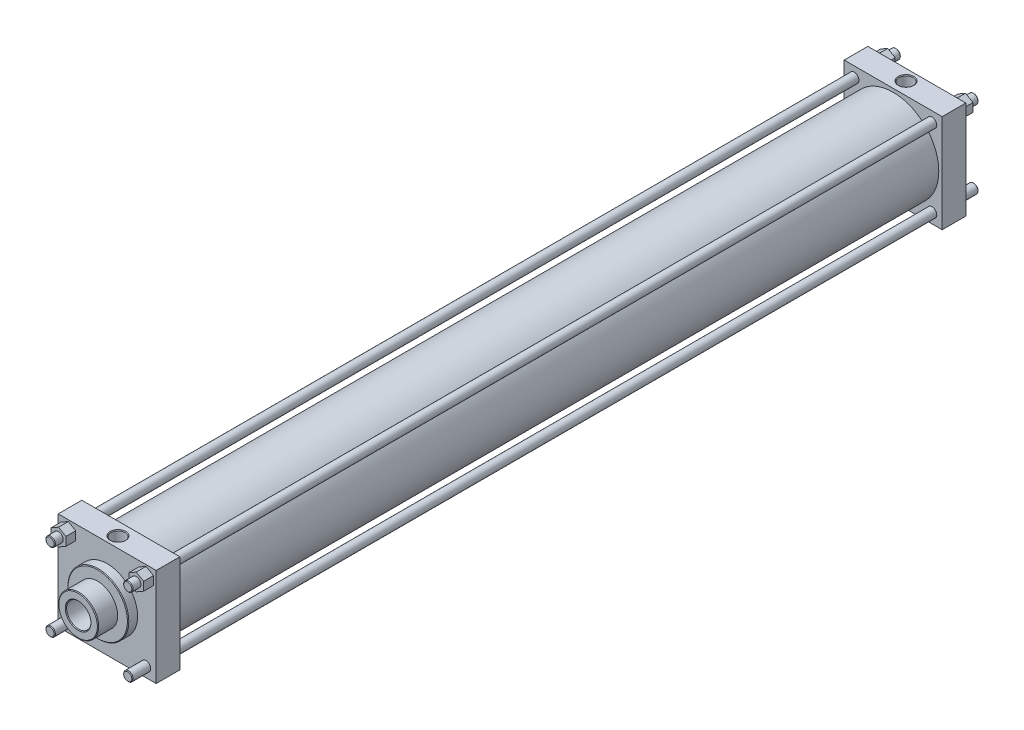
from build123d import *

# Parameters (mm, degrees)
BASE_EXTRUDE_DEPTH      = 599
BASE_EXTRUDE_DEPTH_BACK = 599
SKETCH1_R               = 67.5
SKETCH2_W               = 35
SKETCH2_H               = 145
COVERS_DEPTH            = 72.5
TIERODS_START           = -626
SKETCH4_R               = 7
TIERODS_DEPTH           = 1252
PORTS_START             = -72.5
SKETCH5_R               = 10.5
PORTS_DEPTH             = 72.5
BORE_START              = -1194.5
SKETCH6_R               = 18
BORE_DEPTH              = 1194.5
SKETCH7_R               = 62.5
STROKECHAMBER_DEPTH     = 1105
CHAMFER1_SIZE           = 1
FRONTTOPNUTS_DEPTH      = 14.5
REARTOPNUTS_DEPTH       = 14.5


with BuildPart() as part:
    # Sketch1 → Base-Extrude (new, two sides: drawn at the far end of the back side and taken through both)
    with BuildSketch(Plane.XY.offset(-BASE_EXTRUDE_DEPTH_BACK)):
        Circle(SKETCH1_R)
    extrude(amount=BASE_EXTRUDE_DEPTH + BASE_EXTRUDE_DEPTH_BACK)

    # Sketch2 → Covers (add, symmetric)
    with BuildSketch(Plane(origin=(0, 0, 0), x_dir=(0, 0, -1), z_dir=(1, 0, 0))):
        with Locations((-581.5, 0)):
            Rectangle(SKETCH2_W, SKETCH2_H)
        with Locations((581.5, 0)):
            Rectangle(SKETCH2_W, SKETCH2_H)
    extrude(amount=COVERS_DEPTH, both=True)

    # Sketch3 → CoverNose (revolve)
    with BuildSketch(Plane(origin=(0, 0, 0), x_dir=(0, 0, -1), z_dir=(1, 0, 0)), mode=Mode.PRIVATE) as covernose_sk:
        Polygon((-599, 45), (-613, 45), (-613, 29.5), (-642, 29.5), (-642, 0), (-599, 0), align=None)
    revolve(covernose_sk.sketch.rotate(Axis((0, 0, 0), (0, 0, 1)), 90), axis=Axis((0, 0, 0), (0, 0, 1)))

    # Sketch4 → TieRods (add)
    with BuildSketch(Plane.XY.offset(TIERODS_START)):
        with Locations((57.5, 57.5)):
            Circle(SKETCH4_R)
        with Locations((-57.5, 57.5)):
            Circle(SKETCH4_R)
        with Locations((-57.5, -57.5)):
            Circle(SKETCH4_R)
        with Locations((57.5, -57.5)):
            Circle(SKETCH4_R)
    extrude(amount=TIERODS_DEPTH)

    # Sketch5 → Ports (cut)
    with BuildSketch(Plane(origin=(0, 72.5, 0), x_dir=(-1, 0, 0), z_dir=(0, 1, 0)).offset(PORTS_START)):
        with Locations(Location((0, 583, 0), (0, 0, 90))):
            Circle(SKETCH5_R)
        with Locations(Location((0, -583, 0), (0, 0, 90))):
            Circle(SKETCH5_R)
    extrude(amount=PORTS_DEPTH, mode=Mode.SUBTRACT)

    # Sketch6 → Bore (cut)
    with BuildSketch(Plane.XY.offset(642).offset(BORE_START)):
        Circle(SKETCH6_R)
    extrude(amount=BORE_DEPTH, mode=Mode.SUBTRACT)

    # Sketch7 → StrokeChamber (cut)
    with BuildSketch(Plane.XY.offset(-552.5)):
        Circle(SKETCH7_R)
    extrude(amount=STROKECHAMBER_DEPTH, mode=Mode.SUBTRACT)

    # Chamfer1
    chamfer1_edges = [part.edges().sort_by_distance(p)[0] for p in [
        (45, 0, 613),
        (29.5, 0, 642),
        (50.5, 57.5, 626),
        (50.5, 57.5, -626),
        (-64.5, 57.5, 626),
        (-64.5, 57.5, -626),
        (-64.5, -57.5, 626),
        (-64.5, -57.5, -626),
        (50.5, -57.5, 626),
        (50.5, -57.5, -626),
        (0, 72.5, 572.5),
        (0, 72.5, -593.5),
        (-18, 0, 642),
    ]]
    chamfer(chamfer1_edges, length=CHAMFER1_SIZE)

    # Sketch8 → FrontTopNuts (add)
    with BuildSketch(Plane.XY.offset(599)):
        Polygon((68.5, 63.850852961), (57.5, 70.201705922), (46.5, 63.850852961), (46.5, 51.149147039), (57.5, 44.798294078), (68.5, 51.149147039), align=None)
        Polygon((-57.5, 70.201705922), (-68.5, 63.850852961), (-68.5, 51.149147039), (-57.5, 44.798294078), (-46.5, 51.149147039), (-46.5, 63.850852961), align=None)
    extrude(amount=FRONTTOPNUTS_DEPTH)

    # Sketch10 → RearTopNuts (add)
    with BuildSketch(Plane(origin=(0, 0, -599), x_dir=(-1, 0, 0), z_dir=(0, 0, -1))):
        Polygon((-46.5, 63.850852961), (-57.5, 70.201705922), (-68.5, 63.850852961), (-68.5, 51.149147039), (-57.5, 44.798294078), (-46.5, 51.149147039), align=None)
        Polygon((68.5, 63.850852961), (57.5, 70.201705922), (46.5, 63.850852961), (46.5, 51.149147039), (57.5, 44.798294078), (68.5, 51.149147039), align=None)
    extrude(amount=REARTOPNUTS_DEPTH)


solid = part.part
